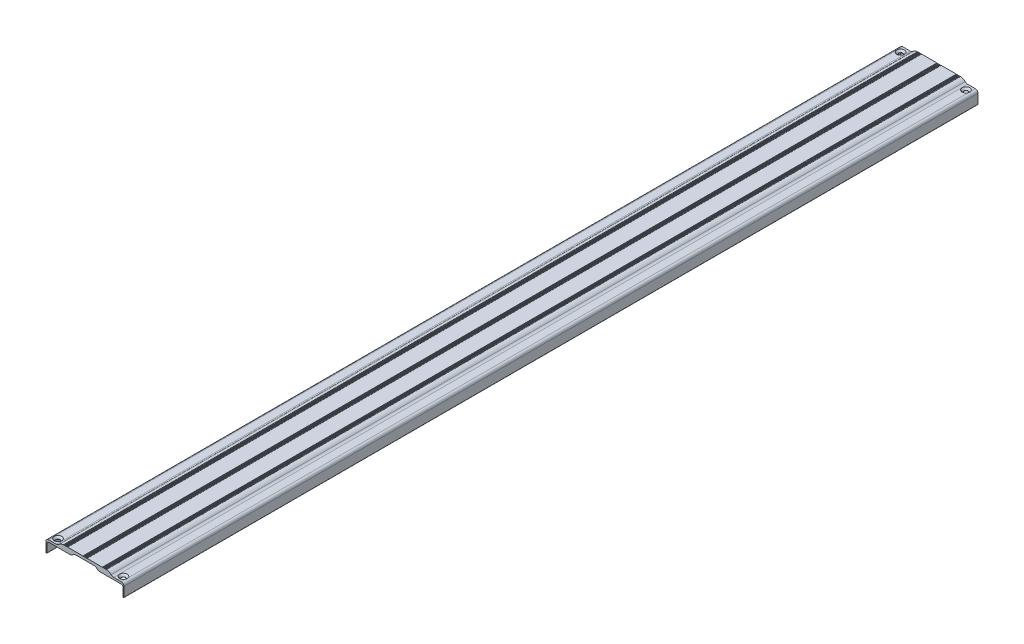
from build123d import *

# Parameters (mm, degrees)
EXTRUDE_1_DEPTH           = 483
HOLE_WIZARD_1_D           = 4.5
HOLE_WIZARD_1_CSINK_D     = 8.6
HOLE_WIZARD_1_CSINK_ANGLE = 90


with BuildPart() as part:
    # Model → Extrude 1 (new, symmetric)
    with BuildSketch(Plane.XY):
        with BuildLine():
            Line((84.849300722, 20.008532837), (93.559826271, 20.008532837))
            ThreePointArc((93.559826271, 20.008532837), (95.681146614, 19.129853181), (96.559826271, 17.008532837))
            Line((96.559826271, 17.008532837), (96.559826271, 6.208532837))
            ThreePointArc((96.559826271, 6.208532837), (96.413379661, 5.854979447), (96.059826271, 5.708532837))
            Line((96.059826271, 5.708532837), (95.959826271, 5.708532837))
            ThreePointArc((95.959826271, 5.708532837), (95.60627288, 5.854979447), (95.459826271, 6.208532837))
            Line((95.459826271, 6.208532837), (95.459826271, 15.608532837))
            ThreePointArc((95.459826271, 15.608532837), (94.874039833, 17.0227464), (93.459826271, 17.608532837))
            Line((93.459826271, 17.608532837), (69.545938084, 17.608532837))
            ThreePointArc((69.545938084, 17.608532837), (67.700116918, 17.961711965), (66.115057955, 18.971355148))
            Line((66.115057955, 18.971355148), (66.004594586, 19.075553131))
            ThreePointArc((66.004594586, 19.075553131), (64.419535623, 20.085196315), (62.573714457, 20.438375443))
            Line((62.573714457, 20.438375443), (42.345938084, 20.438375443))
            ThreePointArc((42.345938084, 20.438375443), (40.500116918, 20.085196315), (38.915057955, 19.075553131))
            Line((38.915057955, 19.075553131), (38.804594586, 18.971355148))
            ThreePointArc((38.804594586, 18.971355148), (37.219535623, 17.961711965), (35.373714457, 17.608532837))
            Line((35.373714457, 17.608532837), (11.459826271, 17.608532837))
            ThreePointArc((11.459826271, 17.608532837), (10.045612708, 17.0227464), (9.459826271, 15.608532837))
            Line((9.459826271, 15.608532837), (9.459826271, 6.208532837))
            ThreePointArc((9.459826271, 6.208532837), (9.313379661, 5.854979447), (8.959826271, 5.708532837))
            Line((8.959826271, 5.708532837), (8.859826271, 5.708532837))
            ThreePointArc((8.859826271, 5.708532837), (8.50627288, 5.854979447), (8.359826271, 6.208532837))
            Line((8.359826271, 6.208532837), (8.359826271, 17.008532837))
            ThreePointArc((8.359826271, 17.008532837), (9.238505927, 19.129853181), (11.359826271, 20.008532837))
            Line((11.359826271, 20.008532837), (20.070351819, 20.008532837))
            ThreePointArc((20.070351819, 20.008532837), (21.597877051, 20.311687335), (22.89386421, 21.175199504))
            ThreePointArc((22.89386421, 21.175199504), (25.292357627, 22.81928136), (28.12005187, 23.497456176))
            ThreePointArc((28.12005187, 23.497456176), (28.438437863, 23.309105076), (28.775117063, 23.462378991))
            ThreePointArc((28.775117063, 23.462378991), (28.81708082, 23.496378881), (28.869704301, 23.508532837))
            Line((28.869704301, 23.508532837), (29.04994824, 23.508532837))
            ThreePointArc((29.04994824, 23.508532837), (29.102571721, 23.496378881), (29.144535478, 23.462378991))
            ThreePointArc((29.144535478, 23.462378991), (29.459826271, 23.308532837), (29.775117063, 23.462378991))
            ThreePointArc((29.775117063, 23.462378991), (29.81708082, 23.496378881), (29.869704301, 23.508532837))
            Line((29.869704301, 23.508532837), (30.04994824, 23.508532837))
            ThreePointArc((30.04994824, 23.508532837), (30.102571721, 23.496378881), (30.144535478, 23.462378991))
            ThreePointArc((30.144535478, 23.462378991), (30.459826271, 23.308532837), (30.775117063, 23.462378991))
            ThreePointArc((30.775117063, 23.462378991), (30.81708082, 23.496378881), (30.869704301, 23.508532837))
            Line((30.869704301, 23.508532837), (31.04994824, 23.508532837))
            ThreePointArc((31.04994824, 23.508532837), (31.102571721, 23.496378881), (31.144535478, 23.462378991))
            ThreePointArc((31.144535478, 23.462378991), (31.459826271, 23.308532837), (31.775117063, 23.462378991))
            ThreePointArc((31.775117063, 23.462378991), (31.81708082, 23.496378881), (31.869704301, 23.508532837))
            Line((31.869704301, 23.508532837), (32.04994824, 23.508532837))
            ThreePointArc((32.04994824, 23.508532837), (32.102571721, 23.496378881), (32.144535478, 23.462378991))
            ThreePointArc((32.144535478, 23.462378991), (32.459826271, 23.308532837), (32.775117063, 23.462378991))
            ThreePointArc((32.775117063, 23.462378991), (32.81708082, 23.496378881), (32.869704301, 23.508532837))
            Line((32.869704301, 23.508532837), (50.04994824, 23.508532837))
            ThreePointArc((50.04994824, 23.508532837), (50.102571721, 23.496378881), (50.144535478, 23.462378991))
            ThreePointArc((50.144535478, 23.462378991), (50.459826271, 23.308532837), (50.775117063, 23.462378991))
            ThreePointArc((50.775117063, 23.462378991), (50.81708082, 23.496378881), (50.869704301, 23.508532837))
            Line((50.869704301, 23.508532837), (51.04994824, 23.508532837))
            ThreePointArc((51.04994824, 23.508532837), (51.102571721, 23.496378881), (51.144535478, 23.462378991))
            ThreePointArc((51.144535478, 23.462378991), (51.459826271, 23.308532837), (51.775117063, 23.462378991))
            ThreePointArc((51.775117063, 23.462378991), (51.81708082, 23.496378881), (51.869704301, 23.508532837))
            Line((51.869704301, 23.508532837), (52.04994824, 23.508532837))
            ThreePointArc((52.04994824, 23.508532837), (52.102571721, 23.496378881), (52.144535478, 23.462378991))
            ThreePointArc((52.144535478, 23.462378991), (52.459826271, 23.308532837), (52.775117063, 23.462378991))
            ThreePointArc((52.775117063, 23.462378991), (52.81708082, 23.496378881), (52.869704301, 23.508532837))
            Line((52.869704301, 23.508532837), (53.04994824, 23.508532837))
            ThreePointArc((53.04994824, 23.508532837), (53.102571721, 23.496378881), (53.144535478, 23.462378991))
            ThreePointArc((53.144535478, 23.462378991), (53.459826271, 23.308532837), (53.775117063, 23.462378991))
            ThreePointArc((53.775117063, 23.462378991), (53.81708082, 23.496378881), (53.869704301, 23.508532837))
            Line((53.869704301, 23.508532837), (54.04994824, 23.508532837))
            ThreePointArc((54.04994824, 23.508532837), (54.102571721, 23.496378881), (54.144535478, 23.462378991))
            ThreePointArc((54.144535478, 23.462378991), (54.459826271, 23.308532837), (54.775117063, 23.462378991))
            ThreePointArc((54.775117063, 23.462378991), (54.81708082, 23.496378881), (54.869704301, 23.508532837))
            Line((54.869704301, 23.508532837), (72.04994824, 23.508532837))
            ThreePointArc((72.04994824, 23.508532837), (72.102571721, 23.496378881), (72.144535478, 23.462378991))
            ThreePointArc((72.144535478, 23.462378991), (72.459826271, 23.308532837), (72.775117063, 23.462378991))
            ThreePointArc((72.775117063, 23.462378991), (72.81708082, 23.496378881), (72.869704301, 23.508532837))
            Line((72.869704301, 23.508532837), (73.04994824, 23.508532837))
            ThreePointArc((73.04994824, 23.508532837), (73.102571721, 23.496378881), (73.144535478, 23.462378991))
            ThreePointArc((73.144535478, 23.462378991), (73.459826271, 23.308532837), (73.775117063, 23.462378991))
            ThreePointArc((73.775117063, 23.462378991), (73.81708082, 23.496378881), (73.869704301, 23.508532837))
            Line((73.869704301, 23.508532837), (74.04994824, 23.508532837))
            ThreePointArc((74.04994824, 23.508532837), (74.102571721, 23.496378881), (74.144535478, 23.462378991))
            ThreePointArc((74.144535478, 23.462378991), (74.459826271, 23.308532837), (74.775117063, 23.462378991))
            ThreePointArc((74.775117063, 23.462378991), (74.81708082, 23.496378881), (74.869704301, 23.508532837))
            Line((74.869704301, 23.508532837), (75.04994824, 23.508532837))
            ThreePointArc((75.04994824, 23.508532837), (75.102571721, 23.496378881), (75.144535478, 23.462378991))
            ThreePointArc((75.144535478, 23.462378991), (75.459826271, 23.308532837), (75.775117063, 23.462378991))
            ThreePointArc((75.775117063, 23.462378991), (75.81708082, 23.496378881), (75.869704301, 23.508532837))
            Line((75.869704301, 23.508532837), (76.04994824, 23.508532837))
            ThreePointArc((76.04994824, 23.508532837), (76.102571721, 23.496378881), (76.144535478, 23.462378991))
            ThreePointArc((76.144535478, 23.462378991), (76.481214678, 23.309105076), (76.799600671, 23.497456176))
            ThreePointArc((76.799600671, 23.497456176), (79.627294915, 22.81928136), (82.025788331, 21.175199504))
            ThreePointArc((82.025788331, 21.175199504), (83.32177549, 20.311687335), (84.849300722, 20.008532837))
        make_face()
    extrude(amount=EXTRUDE_1_DEPTH, both=True)

    # Hole Wizard 1 (through all)
    with Locations(Plane(origin=(0, 20.008532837, 0), x_dir=(1, 0, 0), z_dir=(0, 1, 0))):
        with Locations((15.459826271, 476.5), (89.459826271, 476.5), (15.459826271, -476.5), (89.459826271, -476.5)):
            CounterSinkHole(HOLE_WIZARD_1_D / 2, HOLE_WIZARD_1_CSINK_D / 2, counter_sink_angle=HOLE_WIZARD_1_CSINK_ANGLE)


solid = part.part
